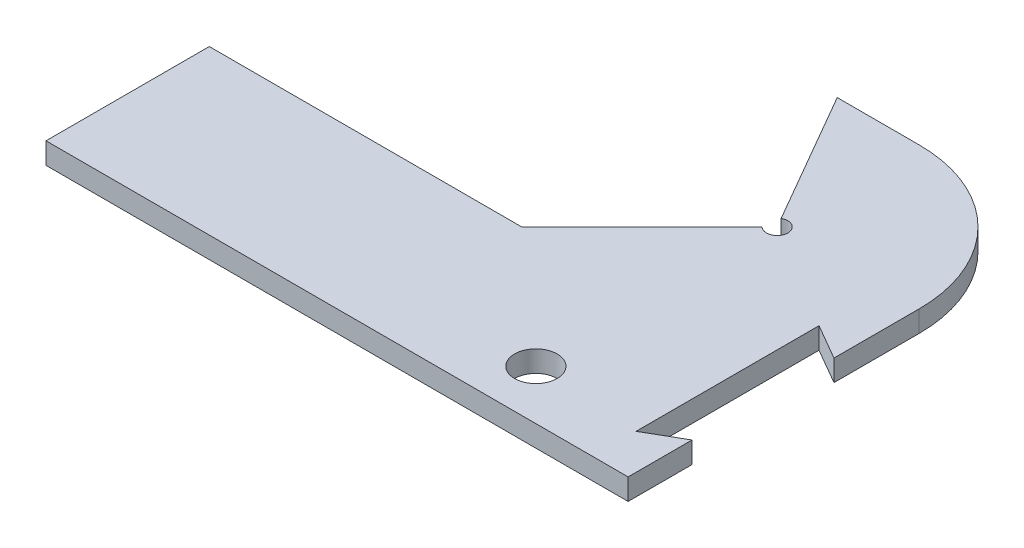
from build123d import *

# Parameters (mm, degrees)
SKETCH1_R      = 3
EXTRUDE1_DEPTH = 3


with BuildPart() as part:
    # Sketch1 → Extrude1 (new body)
    with BuildSketch(Plane(origin=(0, 0, 0), x_dir=(1, 0, 0), z_dir=(0, 1, 0))):
        with BuildLine():
            Line((0, 23), (44, 23))
            Line((44, 23), (60.939339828, 39.939339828))
            ThreePointArc((60.939339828, 39.939339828), (63.487167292, 40.804210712), (61.25, 42.299038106))
            Line((61.25, 42.299038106), (50.452994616, 61))
            Line((50.452994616, 61), (62, 61))
            ThreePointArc((62, 61), (76.142135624, 55.142135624), (82, 41))
            Line((82, 41), (82, 29))
            Line((82, 29), (77, 31.886751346))
            Line((77, 31.886751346), (77, 6.113248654))
            Line((77, 6.113248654), (82, 9))
            Line((82, 9), (82, 0))
            Line((82, 0), (0, 0))
            Line((0, 0), (0, 23))
        make_face()
        with Locations(Location((62, 7, 0), (0, 0, 270))):
            Circle(SKETCH1_R, mode=Mode.SUBTRACT)
    extrude(amount=EXTRUDE1_DEPTH)


solid = part.part
